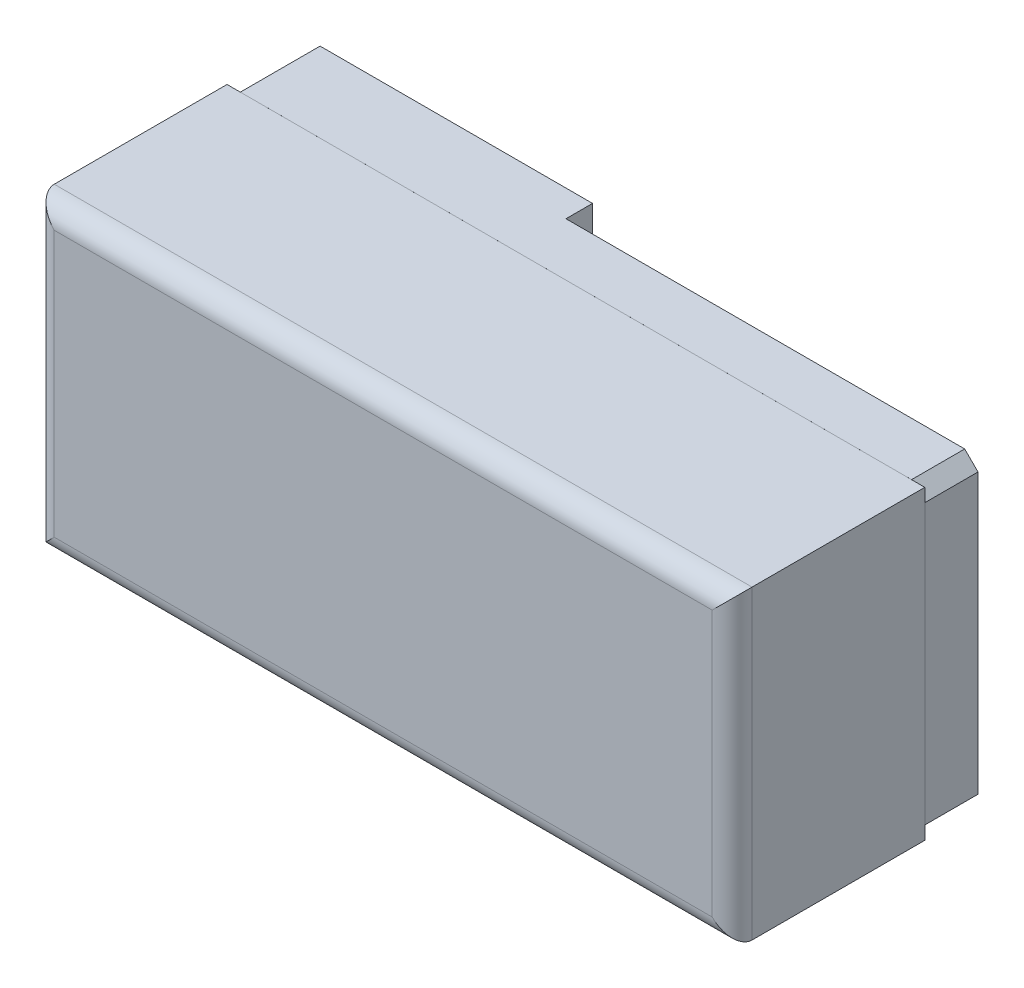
from build123d import *

# Parameters (mm, degrees)
SKETCH_1_W          = 105
SKETCH_1_H          = 46
EXTRUDE_1_DEPTH     = 12
SKETCH_2_R          = 8
CUT_EXTRUDE_1_DEPTH = 20
HOLE_WIZARD_M4_1_D  = 3.3
CHAMFER_2_SIZE      = 2
SKETCH_9_W          = 84.922493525
SKETCH_9_H          = 69.640450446
CUT_EXTRUDE_4_DEPTH = 4
SKETCH_10_W         = 105
SKETCH_10_H         = 46
EXTRUDE_2_DEPTH     = 29
FILLET_1_R          = 3
SKETCH_11_W         = 121.058889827
SKETCH_11_H         = 57.882033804
CUT_EXTRUDE_5_DEPTH = 0.001


with BuildPart() as part:
    # Sketch 1 → Extrude 1 (new body)
    with BuildSketch(Plane.XY):
        Rectangle(SKETCH_1_W, SKETCH_1_H)
    extrude(amount=EXTRUDE_1_DEPTH)

    # Sketch 2 → Cut-Extrude 1 (cut)
    with BuildSketch(Plane.XY.offset(12)):
        with Locations((-31.5, 0)):
            Circle(SKETCH_2_R)
        with BuildLine():
            Line((22, 5), (32, 5))
            ThreePointArc((32, 5), (37, 0), (32, -5))
            Line((32, -5), (22, -5))
            ThreePointArc((22, -5), (17, 0), (22, 5))
        make_face()
    extrude(amount=-CUT_EXTRUDE_1_DEPTH, mode=Mode.SUBTRACT)

    # Hole Wizard M4 _1 (through all)
    with Locations(Plane(origin=(-14.5, 0, 12), x_dir=(1, 0, 0), z_dir=(0, 0, 1))):
        with Locations((0, 0), (58, 0)):
            Hole(HOLE_WIZARD_M4_1_D / 2)

    # Chamfer 2
    chamfer_2_edges = [part.edges().sort_by_distance(p)[0] for p in [
        (52.5, -23, 6),
        (-52.5, -23, 6),
        (-52.5, 23, 6),
        (52.5, 23, 6),
    ]]
    chamfer(chamfer_2_edges, length=CHAMFER_2_SIZE)

    # Sketch 9 → Cut-Extrude 4 (cut)
    with BuildSketch(Plane(origin=(0, 0, 0), x_dir=(-1, 0, 0), z_dir=(0, 0, -1))):
        with Locations((-32.961246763, 2.342451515)):
            Rectangle(SKETCH_9_W, SKETCH_9_H)
    extrude(amount=-CUT_EXTRUDE_4_DEPTH, mode=Mode.SUBTRACT)

    # Sketch 10 → Extrude 2 (add)
    with BuildSketch(Plane.XY.offset(12)):
        Rectangle(SKETCH_10_W, SKETCH_10_H)
    extrude(amount=EXTRUDE_2_DEPTH)

    # Fillet 1
    fillet_1_edges = [part.edges().sort_by_distance(p)[0] for p in [
        (0, -23, 41),
        (52.5, 0, 41),
        (0, 23, 41),
        (-52.5, 0, 41),
    ]]
    fillet(fillet_1_edges, radius=FILLET_1_R)

    # Sketch 11 → Cut-Extrude 5 (cut)
    with BuildSketch(Plane(origin=(0, 0, 12), x_dir=(-1, 0, 0), z_dir=(0, 0, -1))):
        with Locations((0.240673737, -1.684716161)):
            Rectangle(SKETCH_11_W, SKETCH_11_H)
    extrude(amount=-CUT_EXTRUDE_5_DEPTH, mode=Mode.SUBTRACT)


with BuildPart() as cut_extrude_5_piece_1:
    # of the separate pieces the step leaves, piece 1, a body of its own (cut_extrude_5_pieces)
    add(part.part.solids().sort_by_distance((52.5, 23, 12.001))[0])


with BuildPart() as cut_extrude_5_piece_2:
    # of the separate pieces the step leaves, piece 2, a body of its own (cut_extrude_5_pieces)
    add(part.part.solids().sort_by_distance((50.5, 23, 4))[0])


solid = Compound([cut_extrude_5_piece_1.part, cut_extrude_5_piece_2.part])
